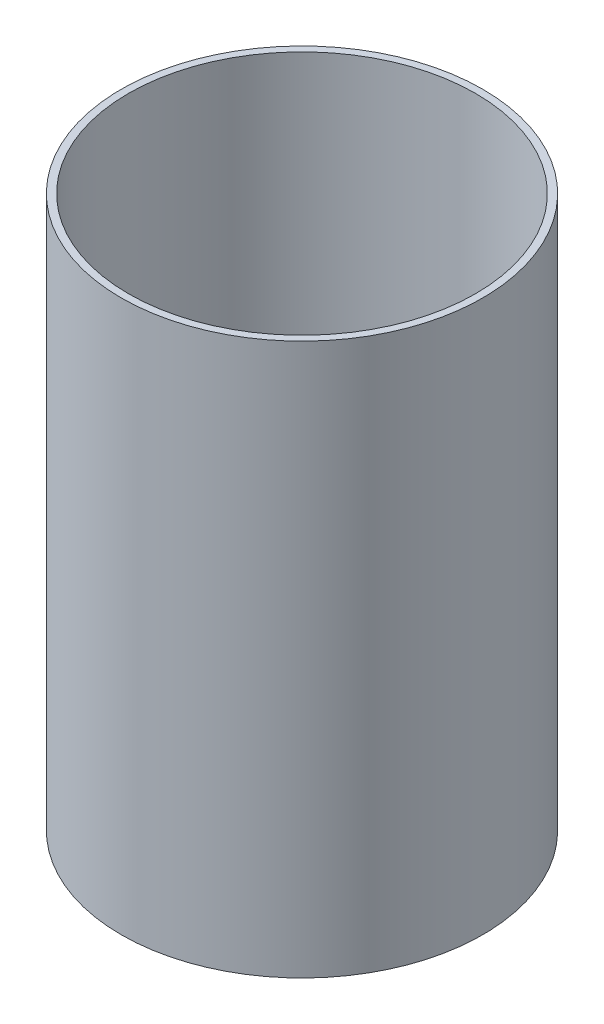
from build123d import *

# Parameters (mm, degrees)
SKETCH1_W = 1.651
SKETCH1_H = 125.9332


with BuildPart() as part:
    # Sketch1 → Base-Revolve (revolve)
    with BuildSketch(Plane.XY, mode=Mode.PRIVATE) as base_revolve_sk:
        with Locations((40.4495, 0)):
            Rectangle(SKETCH1_W, SKETCH1_H)
    revolve(base_revolve_sk.sketch.rotate(Axis((0, 88.530080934, 0), (0, -1, 0)), 90), axis=Axis((0, 88.530080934, 0), (0, -1, 0)))


solid = part.part
